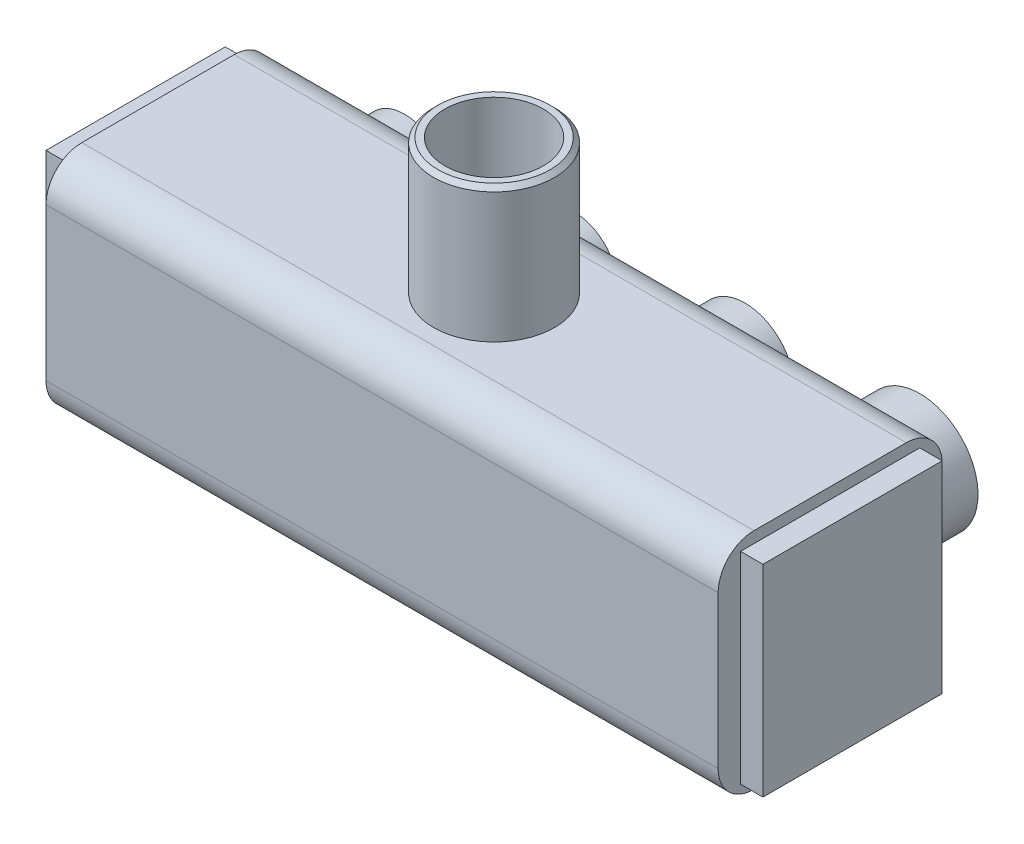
ISO-10303-21;
HEADER;
FILE_DESCRIPTION(('STEP AP214'),'2;1');
FILE_NAME('part.step','',(''),(''),'','','');
FILE_SCHEMA(('AUTOMOTIVE_DESIGN { 1 0 10303 214 1 1 1 1 }'));
ENDSEC;
DATA;
#1=APPLICATION_CONTEXT('core data for automotive mechanical design processes');
#2=APPLICATION_PROTOCOL_DEFINITION('international standard','automotive_design',2000,#1);
#3=PRODUCT_CONTEXT('',#1,'mechanical');
#4=PRODUCT('Part','Part','',(#3));
#5=PRODUCT_RELATED_PRODUCT_CATEGORY('part','',(#4));
#6=PRODUCT_DEFINITION_FORMATION('','',#4);
#7=PRODUCT_DEFINITION_CONTEXT('part definition',#1,'design');
#8=PRODUCT_DEFINITION('design','',#6,#7);
#9=PRODUCT_DEFINITION_SHAPE('','',#8);
#10=(LENGTH_UNIT() NAMED_UNIT(*) SI_UNIT(.MILLI.,.METRE.));
#11=(NAMED_UNIT(*) PLANE_ANGLE_UNIT() SI_UNIT($,.RADIAN.));
#12=(NAMED_UNIT(*) SI_UNIT($,.STERADIAN.) SOLID_ANGLE_UNIT());
#13=UNCERTAINTY_MEASURE_WITH_UNIT(LENGTH_MEASURE(1.E-05),#10,'distance_accuracy_value','');
#14=(GEOMETRIC_REPRESENTATION_CONTEXT(3) GLOBAL_UNCERTAINTY_ASSIGNED_CONTEXT((#13)) GLOBAL_UNIT_ASSIGNED_CONTEXT((#10,
#11,#12)) REPRESENTATION_CONTEXT('',''));
#15=CARTESIAN_POINT('',(0.,0.,0.));
#16=DIRECTION('',(0.,0.,1.));
#17=DIRECTION('',(1.,0.,0.));
#18=AXIS2_PLACEMENT_3D('',#15,#16,#17);
#19=CARTESIAN_POINT('',(-60.,0.,-40.));
#20=DIRECTION('',(0.,0.,-1.));
#21=DIRECTION('',(0.,1.,0.));
#22=AXIS2_PLACEMENT_3D('',#19,#20,#21);
#23=PLANE('',#22);
#24=CARTESIAN_POINT('',(-60.,0.,-40.));
#25=DIRECTION('',(0.,0.,-1.));
#26=DIRECTION('',(0.,1.,0.));
#27=AXIS2_PLACEMENT_3D('',#24,#25,#26);
#28=CIRCLE('',#27,9.5);
#29=CARTESIAN_POINT('',(-60.,9.5,-40.));
#30=VERTEX_POINT('',#29);
#31=EDGE_CURVE('E11',#30,#30,#28,.T.);
#32=ORIENTED_EDGE('',*,*,#31,.T.);
#33=EDGE_LOOP('',(#32));
#34=FACE_BOUND('',#33,.T.);
#35=CARTESIAN_POINT('',(-60.,0.,-40.));
#36=DIRECTION('',(0.,0.,-1.));
#37=DIRECTION('',(0.,1.,0.));
#38=AXIS2_PLACEMENT_3D('',#35,#36,#37);
#39=CIRCLE('',#38,6.);
#40=CARTESIAN_POINT('',(-60.,6.,-40.));
#41=VERTEX_POINT('',#40);
#42=EDGE_CURVE('E52',#41,#41,#39,.T.);
#43=ORIENTED_EDGE('',*,*,#42,.F.);
#44=EDGE_LOOP('',(#43));
#45=FACE_BOUND('',#44,.T.);
#46=ADVANCED_FACE('F41',(#34,#45),#23,.T.);
#47=CARTESIAN_POINT('',(-60.,0.,-10.));
#48=DIRECTION('',(0.,0.,-1.));
#49=DIRECTION('',(0.,1.,0.));
#50=AXIS2_PLACEMENT_3D('',#47,#48,#49);
#51=PLANE('',#50);
#52=CARTESIAN_POINT('',(-60.,0.,-10.));
#53=DIRECTION('',(0.,0.,-1.));
#54=DIRECTION('',(0.,1.,0.));
#55=AXIS2_PLACEMENT_3D('',#52,#53,#54);
#56=CIRCLE('',#55,9.5);
#57=CARTESIAN_POINT('',(-60.,9.5,-10.));
#58=VERTEX_POINT('',#57);
#59=EDGE_CURVE('E48',#58,#58,#56,.T.);
#60=ORIENTED_EDGE('',*,*,#59,.F.);
#61=EDGE_LOOP('',(#60));
#62=FACE_BOUND('',#61,.T.);
#63=CARTESIAN_POINT('',(-60.,0.,-10.));
#64=DIRECTION('',(0.,0.,-1.));
#65=DIRECTION('',(0.,1.,0.));
#66=AXIS2_PLACEMENT_3D('',#63,#64,#65);
#67=CIRCLE('',#66,6.);
#68=CARTESIAN_POINT('',(-60.,6.,-10.));
#69=VERTEX_POINT('',#68);
#70=EDGE_CURVE('E56',#69,#69,#67,.T.);
#71=ORIENTED_EDGE('',*,*,#70,.T.);
#72=EDGE_LOOP('',(#71));
#73=FACE_BOUND('',#72,.T.);
#74=ADVANCED_FACE('F62',(#62,#73),#51,.F.);
#75=CARTESIAN_POINT('',(-60.,0.,-40.));
#76=DIRECTION('',(0.,0.,1.));
#77=DIRECTION('',(0.,-1.,0.));
#78=AXIS2_PLACEMENT_3D('',#75,#76,#77);
#79=CYLINDRICAL_SURFACE('',#78,9.5);
#80=ORIENTED_EDGE('',*,*,#31,.F.);
#81=EDGE_LOOP('',(#80));
#82=FACE_BOUND('',#81,.T.);
#83=ORIENTED_EDGE('',*,*,#59,.T.);
#84=EDGE_LOOP('',(#83));
#85=FACE_BOUND('',#84,.T.);
#86=ADVANCED_FACE('F43',(#82,#85),#79,.T.);
#87=CARTESIAN_POINT('',(-60.,0.,-40.));
#88=DIRECTION('',(0.,0.,1.));
#89=DIRECTION('',(0.,-1.,0.));
#90=AXIS2_PLACEMENT_3D('',#87,#88,#89);
#91=CYLINDRICAL_SURFACE('',#90,6.);
#92=ORIENTED_EDGE('',*,*,#42,.T.);
#93=EDGE_LOOP('',(#92));
#94=FACE_BOUND('',#93,.T.);
#95=ORIENTED_EDGE('',*,*,#70,.F.);
#96=EDGE_LOOP('',(#95));
#97=FACE_BOUND('',#96,.T.);
#98=ADVANCED_FACE('F64',(#94,#97),#91,.F.);
#99=CLOSED_SHELL('',(#46,#74,#86,#98));
#100=MANIFOLD_SOLID_BREP('B2',#99);
#101=CARTESIAN_POINT('',(-22.,0.,-40.));
#102=DIRECTION('',(0.,0.,-1.));
#103=DIRECTION('',(0.,1.,0.));
#104=AXIS2_PLACEMENT_3D('',#101,#102,#103);
#105=PLANE('',#104);
#106=CARTESIAN_POINT('',(-22.,0.,-40.));
#107=DIRECTION('',(0.,0.,-1.));
#108=DIRECTION('',(0.,1.,0.));
#109=AXIS2_PLACEMENT_3D('',#106,#107,#108);
#110=CIRCLE('',#109,9.5);
#111=CARTESIAN_POINT('',(-22.,9.5,-40.));
#112=VERTEX_POINT('',#111);
#113=EDGE_CURVE('E40',#112,#112,#110,.T.);
#114=ORIENTED_EDGE('',*,*,#113,.T.);
#115=EDGE_LOOP('',(#114));
#116=FACE_BOUND('',#115,.T.);
#117=CARTESIAN_POINT('',(-22.,0.,-40.));
#118=DIRECTION('',(0.,0.,-1.));
#119=DIRECTION('',(0.,1.,0.));
#120=AXIS2_PLACEMENT_3D('',#117,#118,#119);
#121=CIRCLE('',#120,6.);
#122=CARTESIAN_POINT('',(-22.,6.,-40.));
#123=VERTEX_POINT('',#122);
#124=EDGE_CURVE('E113',#123,#123,#121,.T.);
#125=ORIENTED_EDGE('',*,*,#124,.F.);
#126=EDGE_LOOP('',(#125));
#127=FACE_BOUND('',#126,.T.);
#128=ADVANCED_FACE('F102',(#116,#127),#105,.T.);
#129=CARTESIAN_POINT('',(-22.,0.,-10.));
#130=DIRECTION('',(0.,0.,-1.));
#131=DIRECTION('',(0.,1.,0.));
#132=AXIS2_PLACEMENT_3D('',#129,#130,#131);
#133=PLANE('',#132);
#134=CARTESIAN_POINT('',(-22.,0.,-10.));
#135=DIRECTION('',(0.,0.,-1.));
#136=DIRECTION('',(0.,1.,0.));
#137=AXIS2_PLACEMENT_3D('',#134,#135,#136);
#138=CIRCLE('',#137,9.5);
#139=CARTESIAN_POINT('',(-22.,9.5,-10.));
#140=VERTEX_POINT('',#139);
#141=EDGE_CURVE('E109',#140,#140,#138,.T.);
#142=ORIENTED_EDGE('',*,*,#141,.F.);
#143=EDGE_LOOP('',(#142));
#144=FACE_BOUND('',#143,.T.);
#145=CARTESIAN_POINT('',(-22.,0.,-10.));
#146=DIRECTION('',(0.,0.,-1.));
#147=DIRECTION('',(0.,1.,0.));
#148=AXIS2_PLACEMENT_3D('',#145,#146,#147);
#149=CIRCLE('',#148,6.);
#150=CARTESIAN_POINT('',(-22.,6.,-10.));
#151=VERTEX_POINT('',#150);
#152=EDGE_CURVE('E117',#151,#151,#149,.T.);
#153=ORIENTED_EDGE('',*,*,#152,.T.);
#154=EDGE_LOOP('',(#153));
#155=FACE_BOUND('',#154,.T.);
#156=ADVANCED_FACE('F123',(#144,#155),#133,.F.);
#157=CARTESIAN_POINT('',(-22.,0.,-40.));
#158=DIRECTION('',(0.,0.,1.));
#159=DIRECTION('',(0.,-1.,0.));
#160=AXIS2_PLACEMENT_3D('',#157,#158,#159);
#161=CYLINDRICAL_SURFACE('',#160,9.5);
#162=ORIENTED_EDGE('',*,*,#113,.F.);
#163=EDGE_LOOP('',(#162));
#164=FACE_BOUND('',#163,.T.);
#165=ORIENTED_EDGE('',*,*,#141,.T.);
#166=EDGE_LOOP('',(#165));
#167=FACE_BOUND('',#166,.T.);
#168=ADVANCED_FACE('F104',(#164,#167),#161,.T.);
#169=CARTESIAN_POINT('',(-22.,0.,-40.));
#170=DIRECTION('',(0.,0.,1.));
#171=DIRECTION('',(0.,-1.,0.));
#172=AXIS2_PLACEMENT_3D('',#169,#170,#171);
#173=CYLINDRICAL_SURFACE('',#172,6.);
#174=ORIENTED_EDGE('',*,*,#124,.T.);
#175=EDGE_LOOP('',(#174));
#176=FACE_BOUND('',#175,.T.);
#177=ORIENTED_EDGE('',*,*,#152,.F.);
#178=EDGE_LOOP('',(#177));
#179=FACE_BOUND('',#178,.T.);
#180=ADVANCED_FACE('F125',(#176,#179),#173,.F.);
#181=CLOSED_SHELL('',(#128,#156,#168,#180));
#182=MANIFOLD_SOLID_BREP('B6',#181);
#183=CARTESIAN_POINT('',(16.,0.,-40.));
#184=DIRECTION('',(0.,0.,-1.));
#185=DIRECTION('',(0.,1.,0.));
#186=AXIS2_PLACEMENT_3D('',#183,#184,#185);
#187=PLANE('',#186);
#188=CARTESIAN_POINT('',(16.,0.,-40.));
#189=DIRECTION('',(0.,0.,-1.));
#190=DIRECTION('',(0.,1.,0.));
#191=AXIS2_PLACEMENT_3D('',#188,#189,#190);
#192=CIRCLE('',#191,11.);
#193=CARTESIAN_POINT('',(16.,11.,-40.));
#194=VERTEX_POINT('',#193);
#195=EDGE_CURVE('E101',#194,#194,#192,.T.);
#196=ORIENTED_EDGE('',*,*,#195,.T.);
#197=EDGE_LOOP('',(#196));
#198=FACE_BOUND('',#197,.T.);
#199=CARTESIAN_POINT('',(16.,0.,-40.));
#200=DIRECTION('',(0.,0.,-1.));
#201=DIRECTION('',(0.,1.,0.));
#202=AXIS2_PLACEMENT_3D('',#199,#200,#201);
#203=CIRCLE('',#202,7.75);
#204=CARTESIAN_POINT('',(16.,7.75,-40.));
#205=VERTEX_POINT('',#204);
#206=EDGE_CURVE('E174',#205,#205,#203,.T.);
#207=ORIENTED_EDGE('',*,*,#206,.F.);
#208=EDGE_LOOP('',(#207));
#209=FACE_BOUND('',#208,.T.);
#210=ADVANCED_FACE('F163',(#198,#209),#187,.T.);
#211=CARTESIAN_POINT('',(16.,0.,-10.));
#212=DIRECTION('',(0.,0.,-1.));
#213=DIRECTION('',(0.,1.,0.));
#214=AXIS2_PLACEMENT_3D('',#211,#212,#213);
#215=PLANE('',#214);
#216=CARTESIAN_POINT('',(16.,0.,-10.));
#217=DIRECTION('',(0.,0.,-1.));
#218=DIRECTION('',(0.,1.,0.));
#219=AXIS2_PLACEMENT_3D('',#216,#217,#218);
#220=CIRCLE('',#219,11.);
#221=CARTESIAN_POINT('',(16.,11.,-10.));
#222=VERTEX_POINT('',#221);
#223=EDGE_CURVE('E170',#222,#222,#220,.T.);
#224=ORIENTED_EDGE('',*,*,#223,.F.);
#225=EDGE_LOOP('',(#224));
#226=FACE_BOUND('',#225,.T.);
#227=CARTESIAN_POINT('',(16.,0.,-10.));
#228=DIRECTION('',(0.,0.,-1.));
#229=DIRECTION('',(0.,1.,0.));
#230=AXIS2_PLACEMENT_3D('',#227,#228,#229);
#231=CIRCLE('',#230,7.75);
#232=CARTESIAN_POINT('',(16.,7.75,-10.));
#233=VERTEX_POINT('',#232);
#234=EDGE_CURVE('E178',#233,#233,#231,.T.);
#235=ORIENTED_EDGE('',*,*,#234,.T.);
#236=EDGE_LOOP('',(#235));
#237=FACE_BOUND('',#236,.T.);
#238=ADVANCED_FACE('F184',(#226,#237),#215,.F.);
#239=CARTESIAN_POINT('',(16.,0.,-40.));
#240=DIRECTION('',(0.,0.,1.));
#241=DIRECTION('',(0.,-1.,0.));
#242=AXIS2_PLACEMENT_3D('',#239,#240,#241);
#243=CYLINDRICAL_SURFACE('',#242,11.);
#244=ORIENTED_EDGE('',*,*,#195,.F.);
#245=EDGE_LOOP('',(#244));
#246=FACE_BOUND('',#245,.T.);
#247=ORIENTED_EDGE('',*,*,#223,.T.);
#248=EDGE_LOOP('',(#247));
#249=FACE_BOUND('',#248,.T.);
#250=ADVANCED_FACE('F165',(#246,#249),#243,.T.);
#251=CARTESIAN_POINT('',(16.,0.,-40.));
#252=DIRECTION('',(0.,0.,1.));
#253=DIRECTION('',(0.,-1.,0.));
#254=AXIS2_PLACEMENT_3D('',#251,#252,#253);
#255=CYLINDRICAL_SURFACE('',#254,7.75);
#256=ORIENTED_EDGE('',*,*,#206,.T.);
#257=EDGE_LOOP('',(#256));
#258=FACE_BOUND('',#257,.T.);
#259=ORIENTED_EDGE('',*,*,#234,.F.);
#260=EDGE_LOOP('',(#259));
#261=FACE_BOUND('',#260,.T.);
#262=ADVANCED_FACE('F186',(#258,#261),#255,.F.);
#263=CLOSED_SHELL('',(#210,#238,#250,#262));
#264=MANIFOLD_SOLID_BREP('B35',#263);
#265=CARTESIAN_POINT('',(55.,0.,-10.));
#266=DIRECTION('',(0.,0.,1.));
#267=DIRECTION('',(0.,-1.,0.));
#268=AXIS2_PLACEMENT_3D('',#265,#266,#267);
#269=PLANE('',#268);
#270=CARTESIAN_POINT('',(55.,0.,-10.));
#271=DIRECTION('',(0.,0.,1.));
#272=DIRECTION('',(0.,-1.,0.));
#273=AXIS2_PLACEMENT_3D('',#270,#271,#272);
#274=CIRCLE('',#273,13.);
#275=CARTESIAN_POINT('',(55.,-13.,-10.));
#276=VERTEX_POINT('',#275);
#277=EDGE_CURVE('E162',#276,#276,#274,.T.);
#278=ORIENTED_EDGE('',*,*,#277,.T.);
#279=EDGE_LOOP('',(#278));
#280=FACE_BOUND('',#279,.T.);
#281=CARTESIAN_POINT('',(55.,0.,-10.));
#282=DIRECTION('',(0.,0.,1.));
#283=DIRECTION('',(0.,-1.,0.));
#284=AXIS2_PLACEMENT_3D('',#281,#282,#283);
#285=CIRCLE('',#284,9.5);
#286=CARTESIAN_POINT('',(55.,-9.50000000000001,-10.));
#287=VERTEX_POINT('',#286);
#288=EDGE_CURVE('E235',#287,#287,#285,.T.);
#289=ORIENTED_EDGE('',*,*,#288,.F.);
#290=EDGE_LOOP('',(#289));
#291=FACE_BOUND('',#290,.T.);
#292=ADVANCED_FACE('F224',(#280,#291),#269,.T.);
#293=CARTESIAN_POINT('',(55.,0.,-40.));
#294=DIRECTION('',(0.,0.,1.));
#295=DIRECTION('',(0.,-1.,0.));
#296=AXIS2_PLACEMENT_3D('',#293,#294,#295);
#297=PLANE('',#296);
#298=CARTESIAN_POINT('',(55.,0.,-40.));
#299=DIRECTION('',(0.,0.,1.));
#300=DIRECTION('',(0.,-1.,0.));
#301=AXIS2_PLACEMENT_3D('',#298,#299,#300);
#302=CIRCLE('',#301,13.);
#303=CARTESIAN_POINT('',(55.,-13.,-40.));
#304=VERTEX_POINT('',#303);
#305=EDGE_CURVE('E231',#304,#304,#302,.T.);
#306=ORIENTED_EDGE('',*,*,#305,.F.);
#307=EDGE_LOOP('',(#306));
#308=FACE_BOUND('',#307,.T.);
#309=CARTESIAN_POINT('',(55.,0.,-40.));
#310=DIRECTION('',(0.,0.,1.));
#311=DIRECTION('',(0.,-1.,0.));
#312=AXIS2_PLACEMENT_3D('',#309,#310,#311);
#313=CIRCLE('',#312,9.5);
#314=CARTESIAN_POINT('',(55.,-9.50000000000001,-40.));
#315=VERTEX_POINT('',#314);
#316=EDGE_CURVE('E239',#315,#315,#313,.T.);
#317=ORIENTED_EDGE('',*,*,#316,.T.);
#318=EDGE_LOOP('',(#317));
#319=FACE_BOUND('',#318,.T.);
#320=ADVANCED_FACE('F245',(#308,#319),#297,.F.);
#321=CARTESIAN_POINT('',(55.,0.,-10.));
#322=DIRECTION('',(0.,0.,-1.));
#323=DIRECTION('',(0.,1.,0.));
#324=AXIS2_PLACEMENT_3D('',#321,#322,#323);
#325=CYLINDRICAL_SURFACE('',#324,13.);
#326=ORIENTED_EDGE('',*,*,#277,.F.);
#327=EDGE_LOOP('',(#326));
#328=FACE_BOUND('',#327,.T.);
#329=ORIENTED_EDGE('',*,*,#305,.T.);
#330=EDGE_LOOP('',(#329));
#331=FACE_BOUND('',#330,.T.);
#332=ADVANCED_FACE('F226',(#328,#331),#325,.T.);
#333=CARTESIAN_POINT('',(55.,0.,-10.));
#334=DIRECTION('',(0.,0.,-1.));
#335=DIRECTION('',(0.,1.,0.));
#336=AXIS2_PLACEMENT_3D('',#333,#334,#335);
#337=CYLINDRICAL_SURFACE('',#336,9.5);
#338=ORIENTED_EDGE('',*,*,#288,.T.);
#339=EDGE_LOOP('',(#338));
#340=FACE_BOUND('',#339,.T.);
#341=ORIENTED_EDGE('',*,*,#316,.F.);
#342=EDGE_LOOP('',(#341));
#343=FACE_BOUND('',#342,.T.);
#344=ADVANCED_FACE('F247',(#340,#343),#337,.F.);
#345=CLOSED_SHELL('',(#292,#320,#332,#344));
#346=MANIFOLD_SOLID_BREP('B96',#345);
#347=CARTESIAN_POINT('',(0.,55.,0.));
#348=DIRECTION('',(0.,1.,0.));
#349=DIRECTION('',(0.,0.,1.));
#350=AXIS2_PLACEMENT_3D('',#347,#348,#349);
#351=PLANE('',#350);
#352=CARTESIAN_POINT('',(0.,55.,0.));
#353=DIRECTION('',(0.,1.,0.));
#354=DIRECTION('',(0.,0.,1.));
#355=AXIS2_PLACEMENT_3D('',#352,#353,#354);
#356=CIRCLE('',#355,12.5);
#357=CARTESIAN_POINT('',(0.,55.,12.5));
#358=VERTEX_POINT('',#357);
#359=EDGE_CURVE('E294',#358,#358,#356,.T.);
#360=ORIENTED_EDGE('',*,*,#359,.T.);
#361=EDGE_LOOP('',(#360));
#362=FACE_BOUND('',#361,.T.);
#363=CARTESIAN_POINT('',(0.,55.,0.));
#364=DIRECTION('',(0.,1.,0.));
#365=DIRECTION('',(0.,0.,1.));
#366=AXIS2_PLACEMENT_3D('',#363,#364,#365);
#367=CIRCLE('',#366,11.);
#368=CARTESIAN_POINT('',(0.,55.,11.));
#369=VERTEX_POINT('',#368);
#370=EDGE_CURVE('E302',#369,#369,#367,.T.);
#371=ORIENTED_EDGE('',*,*,#370,.F.);
#372=EDGE_LOOP('',(#371));
#373=FACE_BOUND('',#372,.T.);
#374=ADVANCED_FACE('F287',(#362,#373),#351,.T.);
#375=CARTESIAN_POINT('',(0.,25.,0.));
#376=DIRECTION('',(0.,1.,0.));
#377=DIRECTION('',(0.,0.,1.));
#378=AXIS2_PLACEMENT_3D('',#375,#376,#377);
#379=PLANE('',#378);
#380=CARTESIAN_POINT('',(0.,25.,0.));
#381=DIRECTION('',(0.,1.,0.));
#382=DIRECTION('',(0.,0.,1.));
#383=AXIS2_PLACEMENT_3D('',#380,#381,#382);
#384=CIRCLE('',#383,13.5);
#385=CARTESIAN_POINT('',(0.,25.,13.5));
#386=VERTEX_POINT('',#385);
#387=EDGE_CURVE('E298',#386,#386,#384,.T.);
#388=ORIENTED_EDGE('',*,*,#387,.F.);
#389=EDGE_LOOP('',(#388));
#390=FACE_BOUND('',#389,.T.);
#391=CARTESIAN_POINT('',(0.,25.,0.));
#392=DIRECTION('',(0.,1.,0.));
#393=DIRECTION('',(0.,0.,1.));
#394=AXIS2_PLACEMENT_3D('',#391,#392,#393);
#395=CIRCLE('',#394,11.);
#396=CARTESIAN_POINT('',(0.,25.,11.));
#397=VERTEX_POINT('',#396);
#398=EDGE_CURVE('E307',#397,#397,#395,.T.);
#399=ORIENTED_EDGE('',*,*,#398,.T.);
#400=EDGE_LOOP('',(#399));
#401=FACE_BOUND('',#400,.T.);
#402=ADVANCED_FACE('F311',(#390,#401),#379,.F.);
#403=CARTESIAN_POINT('',(0.,55.,0.));
#404=DIRECTION('',(0.,-1.,0.));
#405=DIRECTION('',(0.,0.,-1.));
#406=AXIS2_PLACEMENT_3D('',#403,#404,#405);
#407=CYLINDRICAL_SURFACE('',#406,13.5);
#408=CARTESIAN_POINT('',(0.,54.,0.));
#409=DIRECTION('',(0.,1.,0.));
#410=DIRECTION('',(0.,0.,1.));
#411=AXIS2_PLACEMENT_3D('',#408,#409,#410);
#412=CIRCLE('',#411,13.5);
#413=CARTESIAN_POINT('',(0.,54.,13.5));
#414=VERTEX_POINT('',#413);
#415=EDGE_CURVE('E223',#414,#414,#412,.F.);
#416=ORIENTED_EDGE('',*,*,#415,.T.);
#417=EDGE_LOOP('',(#416));
#418=FACE_BOUND('',#417,.T.);
#419=ORIENTED_EDGE('',*,*,#387,.T.);
#420=EDGE_LOOP('',(#419));
#421=FACE_BOUND('',#420,.T.);
#422=ADVANCED_FACE('F289',(#418,#421),#407,.T.);
#423=CARTESIAN_POINT('',(0.,55.,0.));
#424=DIRECTION('',(0.,-1.,0.));
#425=DIRECTION('',(0.,0.,-1.));
#426=AXIS2_PLACEMENT_3D('',#423,#424,#425);
#427=CYLINDRICAL_SURFACE('',#426,11.);
#428=ORIENTED_EDGE('',*,*,#370,.T.);
#429=EDGE_LOOP('',(#428));
#430=FACE_BOUND('',#429,.T.);
#431=ORIENTED_EDGE('',*,*,#398,.F.);
#432=EDGE_LOOP('',(#431));
#433=FACE_BOUND('',#432,.T.);
#434=ADVANCED_FACE('F313',(#430,#433),#427,.F.);
#435=CARTESIAN_POINT('',(0.,55.,0.));
#436=DIRECTION('',(0.,-1.,0.));
#437=DIRECTION('',(0.,0.,-1.));
#438=AXIS2_PLACEMENT_3D('',#435,#436,#437);
#439=CONICAL_SURFACE('',#438,12.5,0.785398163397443);
#440=ORIENTED_EDGE('',*,*,#415,.F.);
#441=EDGE_LOOP('',(#440));
#442=FACE_BOUND('',#441,.T.);
#443=ORIENTED_EDGE('',*,*,#359,.F.);
#444=EDGE_LOOP('',(#443));
#445=FACE_BOUND('',#444,.T.);
#446=ADVANCED_FACE('F315',(#442,#445),#439,.T.);
#447=CLOSED_SHELL('',(#374,#402,#422,#434,#446));
#448=MANIFOLD_SOLID_BREP('B157',#447);
#449=CARTESIAN_POINT('',(-80.,-22.5,-20.));
#450=DIRECTION('',(0.,0.,1.));
#451=DIRECTION('',(0.,-1.,0.));
#452=AXIS2_PLACEMENT_3D('',#449,#450,#451);
#453=PLANE('',#452);
#454=DIRECTION('',(-1.,0.,0.));
#455=VECTOR('',#454,1.);
#456=CARTESIAN_POINT('',(-80.,22.5,-20.));
#457=LINE('',#456,#455);
#458=CARTESIAN_POINT('',(-75.,22.5,-20.));
#459=VERTEX_POINT('',#458);
#460=CARTESIAN_POINT('',(-80.,22.5,-20.));
#461=VERTEX_POINT('',#460);
#462=EDGE_CURVE('E412',#459,#461,#457,.T.);
#463=ORIENTED_EDGE('',*,*,#462,.F.);
#464=DIRECTION('',(0.,1.,0.));
#465=VECTOR('',#464,1.);
#466=CARTESIAN_POINT('',(-75.,-22.5,-20.));
#467=LINE('',#466,#465);
#468=CARTESIAN_POINT('',(-75.,-22.5,-20.));
#469=VERTEX_POINT('',#468);
#470=EDGE_CURVE('E431',#469,#459,#467,.T.);
#471=ORIENTED_EDGE('',*,*,#470,.F.);
#472=DIRECTION('',(-1.,0.,0.));
#473=VECTOR('',#472,1.);
#474=CARTESIAN_POINT('',(-80.,-22.5,-20.));
#475=LINE('',#474,#473);
#476=CARTESIAN_POINT('',(-80.,-22.5,-20.));
#477=VERTEX_POINT('',#476);
#478=EDGE_CURVE('E417',#469,#477,#475,.T.);
#479=ORIENTED_EDGE('',*,*,#478,.T.);
#480=DIRECTION('',(0.,1.,0.));
#481=VECTOR('',#480,1.);
#482=CARTESIAN_POINT('',(-80.,-22.5,-20.));
#483=LINE('',#482,#481);
#484=EDGE_CURVE('E285',#477,#461,#483,.T.);
#485=ORIENTED_EDGE('',*,*,#484,.T.);
#486=EDGE_LOOP('',(#463,#471,#479,#485));
#487=FACE_BOUND('',#486,.T.);
#488=ADVANCED_FACE('F364',(#487),#453,.F.);
#489=CARTESIAN_POINT('',(-80.,-22.5,-20.));
#490=DIRECTION('',(1.,0.,0.));
#491=DIRECTION('',(0.,0.,1.));
#492=AXIS2_PLACEMENT_3D('',#489,#490,#491);
#493=PLANE('',#492);
#494=DIRECTION('',(0.,0.,1.));
#495=VECTOR('',#494,1.);
#496=CARTESIAN_POINT('',(-80.,22.5,-20.));
#497=LINE('',#496,#495);
#498=CARTESIAN_POINT('',(-80.,22.5,20.));
#499=VERTEX_POINT('',#498);
#500=EDGE_CURVE('E403',#461,#499,#497,.T.);
#501=ORIENTED_EDGE('',*,*,#500,.F.);
#502=ORIENTED_EDGE('',*,*,#484,.F.);
#503=DIRECTION('',(0.,0.,1.));
#504=VECTOR('',#503,1.);
#505=CARTESIAN_POINT('',(-80.,-22.5,-20.));
#506=LINE('',#505,#504);
#507=CARTESIAN_POINT('',(-80.,-22.5,20.));
#508=VERTEX_POINT('',#507);
#509=EDGE_CURVE('E425',#477,#508,#506,.T.);
#510=ORIENTED_EDGE('',*,*,#509,.T.);
#511=DIRECTION('',(0.,1.,0.));
#512=VECTOR('',#511,1.);
#513=CARTESIAN_POINT('',(-80.,-22.5,20.));
#514=LINE('',#513,#512);
#515=EDGE_CURVE('E371',#508,#499,#514,.T.);
#516=ORIENTED_EDGE('',*,*,#515,.T.);
#517=EDGE_LOOP('',(#501,#502,#510,#516));
#518=FACE_BOUND('',#517,.T.);
#519=ADVANCED_FACE('F404',(#518),#493,.F.);
#520=CARTESIAN_POINT('',(-80.,-22.5,20.));
#521=DIRECTION('',(0.,0.,-1.));
#522=DIRECTION('',(0.,1.,0.));
#523=AXIS2_PLACEMENT_3D('',#520,#521,#522);
#524=PLANE('',#523);
#525=DIRECTION('',(1.,0.,0.));
#526=VECTOR('',#525,1.);
#527=CARTESIAN_POINT('',(-80.,22.5,20.));
#528=LINE('',#527,#526);
#529=CARTESIAN_POINT('',(-75.,22.5,20.));
#530=VERTEX_POINT('',#529);
#531=EDGE_CURVE('E411',#499,#530,#528,.T.);
#532=ORIENTED_EDGE('',*,*,#531,.F.);
#533=ORIENTED_EDGE('',*,*,#515,.F.);
#534=DIRECTION('',(1.,0.,0.));
#535=VECTOR('',#534,1.);
#536=CARTESIAN_POINT('',(-80.,-22.5,20.));
#537=LINE('',#536,#535);
#538=CARTESIAN_POINT('',(-75.,-22.5,20.));
#539=VERTEX_POINT('',#538);
#540=EDGE_CURVE('E427',#508,#539,#537,.T.);
#541=ORIENTED_EDGE('',*,*,#540,.T.);
#542=DIRECTION('',(0.,1.,0.));
#543=VECTOR('',#542,1.);
#544=CARTESIAN_POINT('',(-75.,-22.5,20.));
#545=LINE('',#544,#543);
#546=EDGE_CURVE('E433',#539,#530,#545,.T.);
#547=ORIENTED_EDGE('',*,*,#546,.T.);
#548=EDGE_LOOP('',(#532,#533,#541,#547));
#549=FACE_BOUND('',#548,.T.);
#550=ADVANCED_FACE('F436',(#549),#524,.F.);
#551=CARTESIAN_POINT('',(-75.,-22.5,-20.));
#552=DIRECTION('',(-1.,0.,0.));
#553=DIRECTION('',(0.,0.,-1.));
#554=AXIS2_PLACEMENT_3D('',#551,#552,#553);
#555=PLANE('',#554);
#556=DIRECTION('',(0.,0.,-1.));
#557=VECTOR('',#556,1.);
#558=CARTESIAN_POINT('',(-75.,22.5,-20.));
#559=LINE('',#558,#557);
#560=EDGE_CURVE('E419',#530,#459,#559,.T.);
#561=ORIENTED_EDGE('',*,*,#560,.F.);
#562=ORIENTED_EDGE('',*,*,#546,.F.);
#563=DIRECTION('',(0.,0.,-1.));
#564=VECTOR('',#563,1.);
#565=CARTESIAN_POINT('',(-75.,-22.5,-20.));
#566=LINE('',#565,#564);
#567=EDGE_CURVE('E378',#539,#469,#566,.T.);
#568=ORIENTED_EDGE('',*,*,#567,.T.);
#569=ORIENTED_EDGE('',*,*,#470,.T.);
#570=EDGE_LOOP('',(#561,#562,#568,#569));
#571=FACE_BOUND('',#570,.T.);
#572=ADVANCED_FACE('F437',(#571),#555,.F.);
#573=CARTESIAN_POINT('',(-75.,-22.5,-20.));
#574=DIRECTION('',(0.,1.,0.));
#575=DIRECTION('',(0.,0.,1.));
#576=AXIS2_PLACEMENT_3D('',#573,#574,#575);
#577=PLANE('',#576);
#578=ORIENTED_EDGE('',*,*,#478,.F.);
#579=ORIENTED_EDGE('',*,*,#567,.F.);
#580=ORIENTED_EDGE('',*,*,#540,.F.);
#581=ORIENTED_EDGE('',*,*,#509,.F.);
#582=EDGE_LOOP('',(#578,#579,#580,#581));
#583=FACE_BOUND('',#582,.T.);
#584=ADVANCED_FACE('F439',(#583),#577,.F.);
#585=CARTESIAN_POINT('',(-75.,22.5,-20.));
#586=DIRECTION('',(0.,1.,0.));
#587=DIRECTION('',(0.,0.,1.));
#588=AXIS2_PLACEMENT_3D('',#585,#586,#587);
#589=PLANE('',#588);
#590=ORIENTED_EDGE('',*,*,#462,.T.);
#591=ORIENTED_EDGE('',*,*,#500,.T.);
#592=ORIENTED_EDGE('',*,*,#531,.T.);
#593=ORIENTED_EDGE('',*,*,#560,.T.);
#594=EDGE_LOOP('',(#590,#591,#592,#593));
#595=FACE_BOUND('',#594,.T.);
#596=ADVANCED_FACE('F418',(#595),#589,.T.);
#597=CLOSED_SHELL('',(#488,#519,#550,#572,#584,#596));
#598=MANIFOLD_SOLID_BREP('B218',#597);
#599=CARTESIAN_POINT('',(80.,-22.5,-20.));
#600=DIRECTION('',(0.,0.,1.));
#601=DIRECTION('',(0.,-1.,0.));
#602=AXIS2_PLACEMENT_3D('',#599,#600,#601);
#603=PLANE('',#602);
#604=DIRECTION('',(1.,0.,0.));
#605=VECTOR('',#604,1.);
#606=CARTESIAN_POINT('',(80.,22.5,-20.));
#607=LINE('',#606,#605);
#608=CARTESIAN_POINT('',(75.,22.5,-20.));
#609=VERTEX_POINT('',#608);
#610=CARTESIAN_POINT('',(80.,22.5,-20.));
#611=VERTEX_POINT('',#610);
#612=EDGE_CURVE('E553',#609,#611,#607,.T.);
#613=ORIENTED_EDGE('',*,*,#612,.T.);
#614=DIRECTION('',(0.,1.,0.));
#615=VECTOR('',#614,1.);
#616=CARTESIAN_POINT('',(80.,-22.5,-20.));
#617=LINE('',#616,#615);
#618=CARTESIAN_POINT('',(80.,-22.5,-20.));
#619=VERTEX_POINT('',#618);
#620=EDGE_CURVE('E362',#619,#611,#617,.T.);
#621=ORIENTED_EDGE('',*,*,#620,.F.);
#622=DIRECTION('',(1.,0.,0.));
#623=VECTOR('',#622,1.);
#624=CARTESIAN_POINT('',(80.,-22.5,-20.));
#625=LINE('',#624,#623);
#626=CARTESIAN_POINT('',(75.,-22.5,-20.));
#627=VERTEX_POINT('',#626);
#628=EDGE_CURVE('E571',#627,#619,#625,.T.);
#629=ORIENTED_EDGE('',*,*,#628,.F.);
#630=DIRECTION('',(0.,1.,0.));
#631=VECTOR('',#630,1.);
#632=CARTESIAN_POINT('',(75.,-22.5,-20.));
#633=LINE('',#632,#631);
#634=EDGE_CURVE('E565',#627,#609,#633,.T.);
#635=ORIENTED_EDGE('',*,*,#634,.T.);
#636=EDGE_LOOP('',(#613,#621,#629,#635));
#637=FACE_BOUND('',#636,.T.);
#638=ADVANCED_FACE('F509',(#637),#603,.F.);
#639=CARTESIAN_POINT('',(80.,-22.5,-20.));
#640=DIRECTION('',(-1.,0.,0.));
#641=DIRECTION('',(0.,0.,1.));
#642=AXIS2_PLACEMENT_3D('',#639,#640,#641);
#643=PLANE('',#642);
#644=DIRECTION('',(0.,0.,1.));
#645=VECTOR('',#644,1.);
#646=CARTESIAN_POINT('',(80.,22.5,-20.));
#647=LINE('',#646,#645);
#648=CARTESIAN_POINT('',(80.,22.5,20.));
#649=VERTEX_POINT('',#648);
#650=EDGE_CURVE('E549',#611,#649,#647,.T.);
#651=ORIENTED_EDGE('',*,*,#650,.T.);
#652=DIRECTION('',(0.,1.,0.));
#653=VECTOR('',#652,1.);
#654=CARTESIAN_POINT('',(80.,-22.5,20.));
#655=LINE('',#654,#653);
#656=CARTESIAN_POINT('',(80.,-22.5,20.));
#657=VERTEX_POINT('',#656);
#658=EDGE_CURVE('E516',#657,#649,#655,.T.);
#659=ORIENTED_EDGE('',*,*,#658,.F.);
#660=DIRECTION('',(0.,0.,1.));
#661=VECTOR('',#660,1.);
#662=CARTESIAN_POINT('',(80.,-22.5,-20.));
#663=LINE('',#662,#661);
#664=EDGE_CURVE('E561',#619,#657,#663,.T.);
#665=ORIENTED_EDGE('',*,*,#664,.F.);
#666=ORIENTED_EDGE('',*,*,#620,.T.);
#667=EDGE_LOOP('',(#651,#659,#665,#666));
#668=FACE_BOUND('',#667,.T.);
#669=ADVANCED_FACE('F560',(#668),#643,.F.);
#670=CARTESIAN_POINT('',(80.,-22.5,20.));
#671=DIRECTION('',(0.,0.,-1.));
#672=DIRECTION('',(0.,1.,0.));
#673=AXIS2_PLACEMENT_3D('',#670,#671,#672);
#674=PLANE('',#673);
#675=DIRECTION('',(-1.,0.,0.));
#676=VECTOR('',#675,1.);
#677=CARTESIAN_POINT('',(80.,22.5,20.));
#678=LINE('',#677,#676);
#679=CARTESIAN_POINT('',(75.,22.5,20.));
#680=VERTEX_POINT('',#679);
#681=EDGE_CURVE('E554',#649,#680,#678,.T.);
#682=ORIENTED_EDGE('',*,*,#681,.T.);
#683=DIRECTION('',(0.,1.,0.));
#684=VECTOR('',#683,1.);
#685=CARTESIAN_POINT('',(75.,-22.5,20.));
#686=LINE('',#685,#684);
#687=CARTESIAN_POINT('',(75.,-22.5,20.));
#688=VERTEX_POINT('',#687);
#689=EDGE_CURVE('E577',#688,#680,#686,.T.);
#690=ORIENTED_EDGE('',*,*,#689,.F.);
#691=DIRECTION('',(-1.,0.,0.));
#692=VECTOR('',#691,1.);
#693=CARTESIAN_POINT('',(80.,-22.5,20.));
#694=LINE('',#693,#692);
#695=EDGE_CURVE('E528',#657,#688,#694,.T.);
#696=ORIENTED_EDGE('',*,*,#695,.F.);
#697=ORIENTED_EDGE('',*,*,#658,.T.);
#698=EDGE_LOOP('',(#682,#690,#696,#697));
#699=FACE_BOUND('',#698,.T.);
#700=ADVANCED_FACE('F580',(#699),#674,.F.);
#701=CARTESIAN_POINT('',(75.,-22.5,-20.));
#702=DIRECTION('',(1.,0.,0.));
#703=DIRECTION('',(0.,0.,-1.));
#704=AXIS2_PLACEMENT_3D('',#701,#702,#703);
#705=PLANE('',#704);
#706=DIRECTION('',(0.,0.,-1.));
#707=VECTOR('',#706,1.);
#708=CARTESIAN_POINT('',(75.,22.5,-20.));
#709=LINE('',#708,#707);
#710=EDGE_CURVE('E569',#680,#609,#709,.T.);
#711=ORIENTED_EDGE('',*,*,#710,.T.);
#712=ORIENTED_EDGE('',*,*,#634,.F.);
#713=DIRECTION('',(0.,0.,-1.));
#714=VECTOR('',#713,1.);
#715=CARTESIAN_POINT('',(75.,-22.5,-20.));
#716=LINE('',#715,#714);
#717=EDGE_CURVE('E523',#688,#627,#716,.T.);
#718=ORIENTED_EDGE('',*,*,#717,.F.);
#719=ORIENTED_EDGE('',*,*,#689,.T.);
#720=EDGE_LOOP('',(#711,#712,#718,#719));
#721=FACE_BOUND('',#720,.T.);
#722=ADVANCED_FACE('F582',(#721),#705,.F.);
#723=CARTESIAN_POINT('',(75.,-22.5,-20.));
#724=DIRECTION('',(0.,1.,0.));
#725=DIRECTION('',(0.,0.,1.));
#726=AXIS2_PLACEMENT_3D('',#723,#724,#725);
#727=PLANE('',#726);
#728=ORIENTED_EDGE('',*,*,#628,.T.);
#729=ORIENTED_EDGE('',*,*,#664,.T.);
#730=ORIENTED_EDGE('',*,*,#695,.T.);
#731=ORIENTED_EDGE('',*,*,#717,.T.);
#732=EDGE_LOOP('',(#728,#729,#730,#731));
#733=FACE_BOUND('',#732,.T.);
#734=ADVANCED_FACE('F583',(#733),#727,.F.);
#735=CARTESIAN_POINT('',(75.,22.5,-20.));
#736=DIRECTION('',(0.,1.,0.));
#737=DIRECTION('',(0.,0.,1.));
#738=AXIS2_PLACEMENT_3D('',#735,#736,#737);
#739=PLANE('',#738);
#740=ORIENTED_EDGE('',*,*,#612,.F.);
#741=ORIENTED_EDGE('',*,*,#710,.F.);
#742=ORIENTED_EDGE('',*,*,#681,.F.);
#743=ORIENTED_EDGE('',*,*,#650,.F.);
#744=EDGE_LOOP('',(#740,#741,#742,#743));
#745=FACE_BOUND('',#744,.T.);
#746=ADVANCED_FACE('F550',(#745),#739,.T.);
#747=CLOSED_SHELL('',(#638,#669,#700,#722,#734,#746));
#748=MANIFOLD_SOLID_BREP('B279',#747);
#749=CARTESIAN_POINT('',(75.,17.,-25.));
#750=DIRECTION('',(0.,0.,1.));
#751=DIRECTION('',(1.,0.,0.));
#752=AXIS2_PLACEMENT_3D('',#749,#750,#751);
#753=PLANE('',#752);
#754=CARTESIAN_POINT('',(-22.,0.,-25.));
#755=DIRECTION('',(0.,0.,-1.));
#756=DIRECTION('',(-1.,0.,0.));
#757=AXIS2_PLACEMENT_3D('',#754,#755,#756);
#758=CIRCLE('',#757,9.74999999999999);
#759=CARTESIAN_POINT('',(-31.75,0.,-25.));
#760=VERTEX_POINT('',#759);
#761=EDGE_CURVE('E1176',#760,#760,#758,.T.);
#762=ORIENTED_EDGE('',*,*,#761,.F.);
#763=EDGE_LOOP('',(#762));
#764=FACE_BOUND('',#763,.T.);
#765=DIRECTION('',(0.,1.,0.));
#766=VECTOR('',#765,1.);
#767=CARTESIAN_POINT('',(-75.,17.,-25.));
#768=LINE('',#767,#766);
#769=CARTESIAN_POINT('',(-75.,-17.,-25.));
#770=VERTEX_POINT('',#769);
#771=CARTESIAN_POINT('',(-75.,17.,-25.));
#772=VERTEX_POINT('',#771);
#773=EDGE_CURVE('E817',#770,#772,#768,.T.);
#774=ORIENTED_EDGE('',*,*,#773,.T.);
#775=DIRECTION('',(-1.,0.,0.));
#776=VECTOR('',#775,1.);
#777=CARTESIAN_POINT('',(75.,17.,-25.));
#778=LINE('',#777,#776);
#779=CARTESIAN_POINT('',(75.,17.,-25.));
#780=VERTEX_POINT('',#779);
#781=EDGE_CURVE('E770',#780,#772,#778,.T.);
#782=ORIENTED_EDGE('',*,*,#781,.F.);
#783=DIRECTION('',(0.,1.,0.));
#784=VECTOR('',#783,1.);
#785=CARTESIAN_POINT('',(75.,17.,-25.));
#786=LINE('',#785,#784);
#787=CARTESIAN_POINT('',(75.,-17.,-25.));
#788=VERTEX_POINT('',#787);
#789=EDGE_CURVE('E662',#788,#780,#786,.T.);
#790=ORIENTED_EDGE('',*,*,#789,.F.);
#791=DIRECTION('',(-1.,0.,0.));
#792=VECTOR('',#791,1.);
#793=CARTESIAN_POINT('',(75.,-17.,-25.));
#794=LINE('',#793,#792);
#795=EDGE_CURVE('E856',#788,#770,#794,.T.);
#796=ORIENTED_EDGE('',*,*,#795,.T.);
#797=EDGE_LOOP('',(#774,#782,#790,#796));
#798=FACE_BOUND('',#797,.T.);
#799=CARTESIAN_POINT('',(55.,0.,-25.));
#800=DIRECTION('',(0.,0.,-1.));
#801=DIRECTION('',(-1.,0.,0.));
#802=AXIS2_PLACEMENT_3D('',#799,#800,#801);
#803=CIRCLE('',#802,13.25);
#804=CARTESIAN_POINT('',(41.75,0.,-25.));
#805=VERTEX_POINT('',#804);
#806=EDGE_CURVE('E1158',#805,#805,#803,.T.);
#807=ORIENTED_EDGE('',*,*,#806,.F.);
#808=EDGE_LOOP('',(#807));
#809=FACE_BOUND('',#808,.T.);
#810=CARTESIAN_POINT('',(16.,0.,-25.));
#811=DIRECTION('',(0.,0.,-1.));
#812=DIRECTION('',(-1.,0.,0.));
#813=AXIS2_PLACEMENT_3D('',#810,#811,#812);
#814=CIRCLE('',#813,11.25);
#815=CARTESIAN_POINT('',(4.75000000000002,0.,-25.));
#816=VERTEX_POINT('',#815);
#817=EDGE_CURVE('E1170',#816,#816,#814,.T.);
#818=ORIENTED_EDGE('',*,*,#817,.F.);
#819=EDGE_LOOP('',(#818));
#820=FACE_BOUND('',#819,.T.);
#821=CARTESIAN_POINT('',(-60.,0.,-25.));
#822=DIRECTION('',(0.,0.,-1.));
#823=DIRECTION('',(-1.,0.,0.));
#824=AXIS2_PLACEMENT_3D('',#821,#822,#823);
#825=CIRCLE('',#824,9.74999999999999);
#826=CARTESIAN_POINT('',(-69.75,0.,-25.));
#827=VERTEX_POINT('',#826);
#828=EDGE_CURVE('E1182',#827,#827,#825,.T.);
#829=ORIENTED_EDGE('',*,*,#828,.F.);
#830=EDGE_LOOP('',(#829));
#831=FACE_BOUND('',#830,.T.);
#832=ADVANCED_FACE('F645',(#764,#798,#809,#820,#831),#753,.F.);
#833=CARTESIAN_POINT('',(75.,17.,-17.));
#834=DIRECTION('',(-1.,0.,0.));
#835=DIRECTION('',(0.,0.,1.));
#836=AXIS2_PLACEMENT_3D('',#833,#834,#835);
#837=CYLINDRICAL_SURFACE('',#836,8.00000000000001);
#838=CARTESIAN_POINT('',(-75.,17.,-17.));
#839=DIRECTION('',(1.,0.,0.));
#840=DIRECTION('',(0.,0.,-1.));
#841=AXIS2_PLACEMENT_3D('',#838,#839,#840);
#842=CIRCLE('',#841,8.00000000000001);
#843=CARTESIAN_POINT('',(-75.,25.,-17.));
#844=VERTEX_POINT('',#843);
#845=EDGE_CURVE('E802',#772,#844,#842,.T.);
#846=ORIENTED_EDGE('',*,*,#845,.T.);
#847=DIRECTION('',(-1.,0.,0.));
#848=VECTOR('',#847,1.);
#849=CARTESIAN_POINT('',(75.,25.,-17.));
#850=LINE('',#849,#848);
#851=CARTESIAN_POINT('',(75.,25.,-17.));
#852=VERTEX_POINT('',#851);
#853=EDGE_CURVE('E507',#852,#844,#850,.T.);
#854=ORIENTED_EDGE('',*,*,#853,.F.);
#855=CARTESIAN_POINT('',(75.,17.,-17.));
#856=DIRECTION('',(1.,0.,0.));
#857=DIRECTION('',(0.,0.,-1.));
#858=AXIS2_PLACEMENT_3D('',#855,#856,#857);
#859=CIRCLE('',#858,8.00000000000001);
#860=EDGE_CURVE('E840',#780,#852,#859,.T.);
#861=ORIENTED_EDGE('',*,*,#860,.F.);
#862=ORIENTED_EDGE('',*,*,#781,.T.);
#863=EDGE_LOOP('',(#846,#854,#861,#862));
#864=FACE_BOUND('',#863,.T.);
#865=ADVANCED_FACE('F919',(#864),#837,.T.);
#866=CARTESIAN_POINT('',(75.,25.,-17.));
#867=DIRECTION('',(0.,-1.,0.));
#868=DIRECTION('',(0.,0.,-1.));
#869=AXIS2_PLACEMENT_3D('',#866,#867,#868);
#870=PLANE('',#869);
#871=CARTESIAN_POINT('',(0.,25.,0.));
#872=DIRECTION('',(0.,1.,0.));
#873=DIRECTION('',(0.,0.,1.));
#874=AXIS2_PLACEMENT_3D('',#871,#872,#873);
#875=CIRCLE('',#874,13.25);
#876=CARTESIAN_POINT('',(0.,25.,13.25));
#877=VERTEX_POINT('',#876);
#878=EDGE_CURVE('E778',#877,#877,#875,.T.);
#879=ORIENTED_EDGE('',*,*,#878,.F.);
#880=EDGE_LOOP('',(#879));
#881=FACE_BOUND('',#880,.T.);
#882=DIRECTION('',(0.,0.,1.));
#883=VECTOR('',#882,1.);
#884=CARTESIAN_POINT('',(-75.,25.,-17.));
#885=LINE('',#884,#883);
#886=CARTESIAN_POINT('',(-75.,25.,17.));
#887=VERTEX_POINT('',#886);
#888=EDGE_CURVE('E805',#844,#887,#885,.T.);
#889=ORIENTED_EDGE('',*,*,#888,.T.);
#890=DIRECTION('',(-1.,0.,0.));
#891=VECTOR('',#890,1.);
#892=CARTESIAN_POINT('',(75.,25.,17.));
#893=LINE('',#892,#891);
#894=CARTESIAN_POINT('',(75.,25.,17.));
#895=VERTEX_POINT('',#894);
#896=EDGE_CURVE('E654',#895,#887,#893,.T.);
#897=ORIENTED_EDGE('',*,*,#896,.F.);
#898=DIRECTION('',(0.,0.,1.));
#899=VECTOR('',#898,1.);
#900=CARTESIAN_POINT('',(75.,25.,-17.));
#901=LINE('',#900,#899);
#902=EDGE_CURVE('E842',#852,#895,#901,.T.);
#903=ORIENTED_EDGE('',*,*,#902,.F.);
#904=ORIENTED_EDGE('',*,*,#853,.T.);
#905=EDGE_LOOP('',(#889,#897,#903,#904));
#906=FACE_BOUND('',#905,.T.);
#907=ADVANCED_FACE('F925',(#881,#906),#870,.F.);
#908=CARTESIAN_POINT('',(75.,17.,17.));
#909=DIRECTION('',(-1.,0.,0.));
#910=DIRECTION('',(0.,0.,1.));
#911=AXIS2_PLACEMENT_3D('',#908,#909,#910);
#912=CYLINDRICAL_SURFACE('',#911,8.00000000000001);
#913=CARTESIAN_POINT('',(-75.,17.,17.));
#914=DIRECTION('',(1.,0.,0.));
#915=DIRECTION('',(0.,0.,-1.));
#916=AXIS2_PLACEMENT_3D('',#913,#914,#915);
#917=CIRCLE('',#916,8.00000000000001);
#918=CARTESIAN_POINT('',(-75.,17.,25.));
#919=VERTEX_POINT('',#918);
#920=EDGE_CURVE('E807',#887,#919,#917,.T.);
#921=ORIENTED_EDGE('',*,*,#920,.T.);
#922=DIRECTION('',(-1.,0.,0.));
#923=VECTOR('',#922,1.);
#924=CARTESIAN_POINT('',(75.,17.,25.));
#925=LINE('',#924,#923);
#926=CARTESIAN_POINT('',(75.,17.,25.));
#927=VERTEX_POINT('',#926);
#928=EDGE_CURVE('E868',#927,#919,#925,.T.);
#929=ORIENTED_EDGE('',*,*,#928,.F.);
#930=CARTESIAN_POINT('',(75.,17.,17.));
#931=DIRECTION('',(1.,0.,0.));
#932=DIRECTION('',(0.,0.,-1.));
#933=AXIS2_PLACEMENT_3D('',#930,#931,#932);
#934=CIRCLE('',#933,8.00000000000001);
#935=EDGE_CURVE('E844',#895,#927,#934,.T.);
#936=ORIENTED_EDGE('',*,*,#935,.F.);
#937=ORIENTED_EDGE('',*,*,#896,.T.);
#938=EDGE_LOOP('',(#921,#929,#936,#937));
#939=FACE_BOUND('',#938,.T.);
#940=ADVANCED_FACE('F948',(#939),#912,.T.);
#941=CARTESIAN_POINT('',(75.,-17.,25.));
#942=DIRECTION('',(0.,0.,-1.));
#943=DIRECTION('',(-1.,0.,0.));
#944=AXIS2_PLACEMENT_3D('',#941,#942,#943);
#945=PLANE('',#944);
#946=DIRECTION('',(0.,-1.,0.));
#947=VECTOR('',#946,1.);
#948=CARTESIAN_POINT('',(-75.,-17.,25.));
#949=LINE('',#948,#947);
#950=CARTESIAN_POINT('',(-75.,-17.,25.));
#951=VERTEX_POINT('',#950);
#952=EDGE_CURVE('E809',#919,#951,#949,.T.);
#953=ORIENTED_EDGE('',*,*,#952,.T.);
#954=DIRECTION('',(-1.,0.,0.));
#955=VECTOR('',#954,1.);
#956=CARTESIAN_POINT('',(75.,-17.,25.));
#957=LINE('',#956,#955);
#958=CARTESIAN_POINT('',(75.,-17.,25.));
#959=VERTEX_POINT('',#958);
#960=EDGE_CURVE('E865',#959,#951,#957,.T.);
#961=ORIENTED_EDGE('',*,*,#960,.F.);
#962=DIRECTION('',(0.,-1.,0.));
#963=VECTOR('',#962,1.);
#964=CARTESIAN_POINT('',(75.,-17.,25.));
#965=LINE('',#964,#963);
#966=EDGE_CURVE('E846',#927,#959,#965,.T.);
#967=ORIENTED_EDGE('',*,*,#966,.F.);
#968=ORIENTED_EDGE('',*,*,#928,.T.);
#969=EDGE_LOOP('',(#953,#961,#967,#968));
#970=FACE_BOUND('',#969,.T.);
#971=ADVANCED_FACE('F944',(#970),#945,.F.);
#972=CARTESIAN_POINT('',(75.,-17.,17.));
#973=DIRECTION('',(-1.,0.,0.));
#974=DIRECTION('',(0.,0.,1.));
#975=AXIS2_PLACEMENT_3D('',#972,#973,#974);
#976=CYLINDRICAL_SURFACE('',#975,8.);
#977=CARTESIAN_POINT('',(-75.,-17.,17.));
#978=DIRECTION('',(1.,0.,0.));
#979=DIRECTION('',(0.,0.,-1.));
#980=AXIS2_PLACEMENT_3D('',#977,#978,#979);
#981=CIRCLE('',#980,8.);
#982=CARTESIAN_POINT('',(-75.,-25.,17.));
#983=VERTEX_POINT('',#982);
#984=EDGE_CURVE('E811',#951,#983,#981,.T.);
#985=ORIENTED_EDGE('',*,*,#984,.T.);
#986=DIRECTION('',(-1.,0.,0.));
#987=VECTOR('',#986,1.);
#988=CARTESIAN_POINT('',(75.,-25.,17.));
#989=LINE('',#988,#987);
#990=CARTESIAN_POINT('',(75.,-25.,17.));
#991=VERTEX_POINT('',#990);
#992=EDGE_CURVE('E862',#991,#983,#989,.T.);
#993=ORIENTED_EDGE('',*,*,#992,.F.);
#994=CARTESIAN_POINT('',(75.,-17.,17.));
#995=DIRECTION('',(1.,0.,0.));
#996=DIRECTION('',(0.,0.,-1.));
#997=AXIS2_PLACEMENT_3D('',#994,#995,#996);
#998=CIRCLE('',#997,8.);
#999=EDGE_CURVE('E848',#959,#991,#998,.T.);
#1000=ORIENTED_EDGE('',*,*,#999,.F.);
#1001=ORIENTED_EDGE('',*,*,#960,.T.);
#1002=EDGE_LOOP('',(#985,#993,#1000,#1001));
#1003=FACE_BOUND('',#1002,.T.);
#1004=ADVANCED_FACE('F940',(#1003),#976,.T.);
#1005=CARTESIAN_POINT('',(75.,-25.,17.));
#1006=DIRECTION('',(0.,1.,0.));
#1007=DIRECTION('',(0.,0.,1.));
#1008=AXIS2_PLACEMENT_3D('',#1005,#1006,#1007);
#1009=PLANE('',#1008);
#1010=DIRECTION('',(0.,0.,-1.));
#1011=VECTOR('',#1010,1.);
#1012=CARTESIAN_POINT('',(-75.,-25.,17.));
#1013=LINE('',#1012,#1011);
#1014=CARTESIAN_POINT('',(-75.,-25.,-17.));
#1015=VERTEX_POINT('',#1014);
#1016=EDGE_CURVE('E813',#983,#1015,#1013,.T.);
#1017=ORIENTED_EDGE('',*,*,#1016,.T.);
#1018=DIRECTION('',(-1.,0.,0.));
#1019=VECTOR('',#1018,1.);
#1020=CARTESIAN_POINT('',(75.,-25.,-17.));
#1021=LINE('',#1020,#1019);
#1022=CARTESIAN_POINT('',(75.,-25.,-17.));
#1023=VERTEX_POINT('',#1022);
#1024=EDGE_CURVE('E859',#1023,#1015,#1021,.T.);
#1025=ORIENTED_EDGE('',*,*,#1024,.F.);
#1026=DIRECTION('',(0.,0.,-1.));
#1027=VECTOR('',#1026,1.);
#1028=CARTESIAN_POINT('',(75.,-25.,17.));
#1029=LINE('',#1028,#1027);
#1030=EDGE_CURVE('E850',#991,#1023,#1029,.T.);
#1031=ORIENTED_EDGE('',*,*,#1030,.F.);
#1032=ORIENTED_EDGE('',*,*,#992,.T.);
#1033=EDGE_LOOP('',(#1017,#1025,#1031,#1032));
#1034=FACE_BOUND('',#1033,.T.);
#1035=ADVANCED_FACE('F936',(#1034),#1009,.F.);
#1036=CARTESIAN_POINT('',(75.,-17.,-17.));
#1037=DIRECTION('',(-1.,0.,0.));
#1038=DIRECTION('',(0.,0.,1.));
#1039=AXIS2_PLACEMENT_3D('',#1036,#1037,#1038);
#1040=CYLINDRICAL_SURFACE('',#1039,8.);
#1041=CARTESIAN_POINT('',(-75.,-17.,-17.));
#1042=DIRECTION('',(1.,0.,0.));
#1043=DIRECTION('',(0.,0.,-1.));
#1044=AXIS2_PLACEMENT_3D('',#1041,#1042,#1043);
#1045=CIRCLE('',#1044,8.);
#1046=EDGE_CURVE('E815',#1015,#770,#1045,.T.);
#1047=ORIENTED_EDGE('',*,*,#1046,.T.);
#1048=ORIENTED_EDGE('',*,*,#795,.F.);
#1049=CARTESIAN_POINT('',(75.,-17.,-17.));
#1050=DIRECTION('',(1.,0.,0.));
#1051=DIRECTION('',(0.,0.,-1.));
#1052=AXIS2_PLACEMENT_3D('',#1049,#1050,#1051);
#1053=CIRCLE('',#1052,8.);
#1054=EDGE_CURVE('E667',#1023,#788,#1053,.T.);
#1055=ORIENTED_EDGE('',*,*,#1054,.F.);
#1056=ORIENTED_EDGE('',*,*,#1024,.T.);
#1057=EDGE_LOOP('',(#1047,#1048,#1055,#1056));
#1058=FACE_BOUND('',#1057,.T.);
#1059=ADVANCED_FACE('F933',(#1058),#1040,.T.);
#1060=CARTESIAN_POINT('',(75.,17.,17.));
#1061=DIRECTION('',(-1.,0.,0.));
#1062=DIRECTION('',(0.,0.,1.));
#1063=AXIS2_PLACEMENT_3D('',#1060,#1061,#1062);
#1064=CYLINDRICAL_SURFACE('',#1063,3.);
#1065=CARTESIAN_POINT('',(-75.,17.,17.));
#1066=DIRECTION('',(1.,0.,0.));
#1067=DIRECTION('',(0.,0.,-1.));
#1068=AXIS2_PLACEMENT_3D('',#1065,#1066,#1067);
#1069=CIRCLE('',#1068,3.);
#1070=CARTESIAN_POINT('',(-75.,20.,17.));
#1071=VERTEX_POINT('',#1070);
#1072=CARTESIAN_POINT('',(-75.,17.,20.));
#1073=VERTEX_POINT('',#1072);
#1074=EDGE_CURVE('E773',#1071,#1073,#1069,.T.);
#1075=ORIENTED_EDGE('',*,*,#1074,.F.);
#1076=DIRECTION('',(-1.,0.,0.));
#1077=VECTOR('',#1076,1.);
#1078=CARTESIAN_POINT('',(75.,20.,17.));
#1079=LINE('',#1078,#1077);
#1080=CARTESIAN_POINT('',(75.,20.,17.));
#1081=VERTEX_POINT('',#1080);
#1082=EDGE_CURVE('E649',#1081,#1071,#1079,.T.);
#1083=ORIENTED_EDGE('',*,*,#1082,.F.);
#1084=CARTESIAN_POINT('',(75.,17.,17.));
#1085=DIRECTION('',(1.,0.,0.));
#1086=DIRECTION('',(0.,0.,-1.));
#1087=AXIS2_PLACEMENT_3D('',#1084,#1085,#1086);
#1088=CIRCLE('',#1087,3.);
#1089=CARTESIAN_POINT('',(75.,17.,20.));
#1090=VERTEX_POINT('',#1089);
#1091=EDGE_CURVE('E819',#1081,#1090,#1088,.T.);
#1092=ORIENTED_EDGE('',*,*,#1091,.T.);
#1093=DIRECTION('',(-1.,0.,0.));
#1094=VECTOR('',#1093,1.);
#1095=CARTESIAN_POINT('',(75.,17.,20.));
#1096=LINE('',#1095,#1094);
#1097=EDGE_CURVE('E774',#1090,#1073,#1096,.T.);
#1098=ORIENTED_EDGE('',*,*,#1097,.T.);
#1099=EDGE_LOOP('',(#1075,#1083,#1092,#1098));
#1100=FACE_BOUND('',#1099,.T.);
#1101=ADVANCED_FACE('F647',(#1100),#1064,.F.);
#1102=CARTESIAN_POINT('',(75.,20.,-17.));
#1103=DIRECTION('',(0.,-1.,0.));
#1104=DIRECTION('',(0.,0.,-1.));
#1105=AXIS2_PLACEMENT_3D('',#1102,#1103,#1104);
#1106=PLANE('',#1105);
#1107=CARTESIAN_POINT('',(0.,20.,0.));
#1108=DIRECTION('',(0.,-1.,0.));
#1109=DIRECTION('',(0.,0.,-1.));
#1110=AXIS2_PLACEMENT_3D('',#1107,#1108,#1109);
#1111=CIRCLE('',#1110,13.25);
#1112=CARTESIAN_POINT('',(0.,20.,-13.25));
#1113=VERTEX_POINT('',#1112);
#1114=EDGE_CURVE('E1157',#1113,#1113,#1111,.F.);
#1115=ORIENTED_EDGE('',*,*,#1114,.T.);
#1116=EDGE_LOOP('',(#1115));
#1117=FACE_BOUND('',#1116,.T.);
#1118=DIRECTION('',(0.,0.,1.));
#1119=VECTOR('',#1118,1.);
#1120=CARTESIAN_POINT('',(-75.,20.,-17.));
#1121=LINE('',#1120,#1119);
#1122=CARTESIAN_POINT('',(-75.,20.,-17.));
#1123=VERTEX_POINT('',#1122);
#1124=EDGE_CURVE('E763',#1123,#1071,#1121,.T.);
#1125=ORIENTED_EDGE('',*,*,#1124,.F.);
#1126=DIRECTION('',(-1.,0.,0.));
#1127=VECTOR('',#1126,1.);
#1128=CARTESIAN_POINT('',(75.,20.,-17.));
#1129=LINE('',#1128,#1127);
#1130=CARTESIAN_POINT('',(75.,20.,-17.));
#1131=VERTEX_POINT('',#1130);
#1132=EDGE_CURVE('E771',#1131,#1123,#1129,.T.);
#1133=ORIENTED_EDGE('',*,*,#1132,.F.);
#1134=DIRECTION('',(0.,0.,1.));
#1135=VECTOR('',#1134,1.);
#1136=CARTESIAN_POINT('',(75.,20.,-17.));
#1137=LINE('',#1136,#1135);
#1138=EDGE_CURVE('E766',#1131,#1081,#1137,.T.);
#1139=ORIENTED_EDGE('',*,*,#1138,.T.);
#1140=ORIENTED_EDGE('',*,*,#1082,.T.);
#1141=EDGE_LOOP('',(#1125,#1133,#1139,#1140));
#1142=FACE_BOUND('',#1141,.T.);
#1143=ADVANCED_FACE('F761',(#1117,#1142),#1106,.T.);
#1144=CARTESIAN_POINT('',(75.,17.,-17.));
#1145=DIRECTION('',(-1.,0.,0.));
#1146=DIRECTION('',(0.,0.,1.));
#1147=AXIS2_PLACEMENT_3D('',#1144,#1145,#1146);
#1148=CYLINDRICAL_SURFACE('',#1147,3.);
#1149=CARTESIAN_POINT('',(-75.,17.,-17.));
#1150=DIRECTION('',(1.,0.,0.));
#1151=DIRECTION('',(0.,0.,-1.));
#1152=AXIS2_PLACEMENT_3D('',#1149,#1150,#1151);
#1153=CIRCLE('',#1152,3.);
#1154=CARTESIAN_POINT('',(-75.,17.,-20.));
#1155=VERTEX_POINT('',#1154);
#1156=EDGE_CURVE('E784',#1155,#1123,#1153,.T.);
#1157=ORIENTED_EDGE('',*,*,#1156,.F.);
#1158=DIRECTION('',(-1.,0.,0.));
#1159=VECTOR('',#1158,1.);
#1160=CARTESIAN_POINT('',(75.,17.,-20.));
#1161=LINE('',#1160,#1159);
#1162=CARTESIAN_POINT('',(75.,17.,-20.));
#1163=VERTEX_POINT('',#1162);
#1164=EDGE_CURVE('E882',#1163,#1155,#1161,.T.);
#1165=ORIENTED_EDGE('',*,*,#1164,.F.);
#1166=CARTESIAN_POINT('',(75.,17.,-17.));
#1167=DIRECTION('',(1.,0.,0.));
#1168=DIRECTION('',(0.,0.,-1.));
#1169=AXIS2_PLACEMENT_3D('',#1166,#1167,#1168);
#1170=CIRCLE('',#1169,3.);
#1171=EDGE_CURVE('E822',#1163,#1131,#1170,.T.);
#1172=ORIENTED_EDGE('',*,*,#1171,.T.);
#1173=ORIENTED_EDGE('',*,*,#1132,.T.);
#1174=EDGE_LOOP('',(#1157,#1165,#1172,#1173));
#1175=FACE_BOUND('',#1174,.T.);
#1176=ADVANCED_FACE('F884',(#1175),#1148,.F.);
#1177=CARTESIAN_POINT('',(75.,17.,-20.));
#1178=DIRECTION('',(0.,0.,1.));
#1179=DIRECTION('',(1.,0.,0.));
#1180=AXIS2_PLACEMENT_3D('',#1177,#1178,#1179);
#1181=PLANE('',#1180);
#1182=CARTESIAN_POINT('',(-60.,0.,-20.));
#1183=DIRECTION('',(0.,0.,1.));
#1184=DIRECTION('',(1.,0.,0.));
#1185=AXIS2_PLACEMENT_3D('',#1182,#1183,#1184);
#1186=CIRCLE('',#1185,9.74999999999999);
#1187=CARTESIAN_POINT('',(-50.25,0.,-20.));
#1188=VERTEX_POINT('',#1187);
#1189=EDGE_CURVE('E1179',#1188,#1188,#1186,.T.);
#1190=ORIENTED_EDGE('',*,*,#1189,.F.);
#1191=EDGE_LOOP('',(#1190));
#1192=FACE_BOUND('',#1191,.T.);
#1193=CARTESIAN_POINT('',(-22.,0.,-20.));
#1194=DIRECTION('',(0.,0.,1.));
#1195=DIRECTION('',(1.,0.,0.));
#1196=AXIS2_PLACEMENT_3D('',#1193,#1194,#1195);
#1197=CIRCLE('',#1196,9.74999999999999);
#1198=CARTESIAN_POINT('',(-12.25,0.,-20.));
#1199=VERTEX_POINT('',#1198);
#1200=EDGE_CURVE('E1173',#1199,#1199,#1197,.T.);
#1201=ORIENTED_EDGE('',*,*,#1200,.F.);
#1202=EDGE_LOOP('',(#1201));
#1203=FACE_BOUND('',#1202,.T.);
#1204=CARTESIAN_POINT('',(16.,0.,-20.));
#1205=DIRECTION('',(0.,0.,1.));
#1206=DIRECTION('',(1.,0.,0.));
#1207=AXIS2_PLACEMENT_3D('',#1204,#1205,#1206);
#1208=CIRCLE('',#1207,11.25);
#1209=CARTESIAN_POINT('',(27.25,0.,-20.));
#1210=VERTEX_POINT('',#1209);
#1211=EDGE_CURVE('E1167',#1210,#1210,#1208,.T.);
#1212=ORIENTED_EDGE('',*,*,#1211,.F.);
#1213=EDGE_LOOP('',(#1212));
#1214=FACE_BOUND('',#1213,.T.);
#1215=CARTESIAN_POINT('',(55.,0.,-20.));
#1216=DIRECTION('',(0.,0.,1.));
#1217=DIRECTION('',(1.,0.,0.));
#1218=AXIS2_PLACEMENT_3D('',#1215,#1216,#1217);
#1219=CIRCLE('',#1218,13.25);
#1220=CARTESIAN_POINT('',(68.25,0.,-20.));
#1221=VERTEX_POINT('',#1220);
#1222=EDGE_CURVE('E1162',#1221,#1221,#1219,.F.);
#1223=ORIENTED_EDGE('',*,*,#1222,.T.);
#1224=EDGE_LOOP('',(#1223));
#1225=FACE_BOUND('',#1224,.T.);
#1226=DIRECTION('',(0.,1.,0.));
#1227=VECTOR('',#1226,1.);
#1228=CARTESIAN_POINT('',(-75.,17.,-20.));
#1229=LINE('',#1228,#1227);
#1230=CARTESIAN_POINT('',(-75.,-17.,-20.));
#1231=VERTEX_POINT('',#1230);
#1232=EDGE_CURVE('E786',#1231,#1155,#1229,.T.);
#1233=ORIENTED_EDGE('',*,*,#1232,.F.);
#1234=DIRECTION('',(-1.,0.,0.));
#1235=VECTOR('',#1234,1.);
#1236=CARTESIAN_POINT('',(75.,-17.,-20.));
#1237=LINE('',#1236,#1235);
#1238=CARTESIAN_POINT('',(75.,-17.,-20.));
#1239=VERTEX_POINT('',#1238);
#1240=EDGE_CURVE('E880',#1239,#1231,#1237,.T.);
#1241=ORIENTED_EDGE('',*,*,#1240,.F.);
#1242=DIRECTION('',(0.,1.,0.));
#1243=VECTOR('',#1242,1.);
#1244=CARTESIAN_POINT('',(75.,17.,-20.));
#1245=LINE('',#1244,#1243);
#1246=EDGE_CURVE('E825',#1239,#1163,#1245,.T.);
#1247=ORIENTED_EDGE('',*,*,#1246,.T.);
#1248=ORIENTED_EDGE('',*,*,#1164,.T.);
#1249=EDGE_LOOP('',(#1233,#1241,#1247,#1248));
#1250=FACE_BOUND('',#1249,.T.);
#1251=ADVANCED_FACE('F906',(#1192,#1203,#1214,#1225,#1250),#1181,.T.);
#1252=CARTESIAN_POINT('',(75.,-17.,-17.));
#1253=DIRECTION('',(-1.,0.,0.));
#1254=DIRECTION('',(0.,0.,1.));
#1255=AXIS2_PLACEMENT_3D('',#1252,#1253,#1254);
#1256=CYLINDRICAL_SURFACE('',#1255,3.);
#1257=CARTESIAN_POINT('',(-75.,-17.,-17.));
#1258=DIRECTION('',(1.,0.,0.));
#1259=DIRECTION('',(0.,0.,-1.));
#1260=AXIS2_PLACEMENT_3D('',#1257,#1258,#1259);
#1261=CIRCLE('',#1260,3.);
#1262=CARTESIAN_POINT('',(-75.,-20.,-17.));
#1263=VERTEX_POINT('',#1262);
#1264=EDGE_CURVE('E791',#1263,#1231,#1261,.T.);
#1265=ORIENTED_EDGE('',*,*,#1264,.F.);
#1266=DIRECTION('',(-1.,0.,0.));
#1267=VECTOR('',#1266,1.);
#1268=CARTESIAN_POINT('',(75.,-20.,-17.));
#1269=LINE('',#1268,#1267);
#1270=CARTESIAN_POINT('',(75.,-20.,-17.));
#1271=VERTEX_POINT('',#1270);
#1272=EDGE_CURVE('E878',#1271,#1263,#1269,.T.);
#1273=ORIENTED_EDGE('',*,*,#1272,.F.);
#1274=CARTESIAN_POINT('',(75.,-17.,-17.));
#1275=DIRECTION('',(1.,0.,0.));
#1276=DIRECTION('',(0.,0.,-1.));
#1277=AXIS2_PLACEMENT_3D('',#1274,#1275,#1276);
#1278=CIRCLE('',#1277,3.);
#1279=EDGE_CURVE('E828',#1271,#1239,#1278,.T.);
#1280=ORIENTED_EDGE('',*,*,#1279,.T.);
#1281=ORIENTED_EDGE('',*,*,#1240,.T.);
#1282=EDGE_LOOP('',(#1265,#1273,#1280,#1281));
#1283=FACE_BOUND('',#1282,.T.);
#1284=ADVANCED_FACE('F903',(#1283),#1256,.F.);
#1285=CARTESIAN_POINT('',(75.,-20.,17.));
#1286=DIRECTION('',(0.,1.,0.));
#1287=DIRECTION('',(0.,0.,1.));
#1288=AXIS2_PLACEMENT_3D('',#1285,#1286,#1287);
#1289=PLANE('',#1288);
#1290=DIRECTION('',(0.,0.,-1.));
#1291=VECTOR('',#1290,1.);
#1292=CARTESIAN_POINT('',(-75.,-20.,17.));
#1293=LINE('',#1292,#1291);
#1294=CARTESIAN_POINT('',(-75.,-20.,17.));
#1295=VERTEX_POINT('',#1294);
#1296=EDGE_CURVE('E794',#1295,#1263,#1293,.T.);
#1297=ORIENTED_EDGE('',*,*,#1296,.F.);
#1298=DIRECTION('',(-1.,0.,0.));
#1299=VECTOR('',#1298,1.);
#1300=CARTESIAN_POINT('',(75.,-20.,17.));
#1301=LINE('',#1300,#1299);
#1302=CARTESIAN_POINT('',(75.,-20.,17.));
#1303=VERTEX_POINT('',#1302);
#1304=EDGE_CURVE('E876',#1303,#1295,#1301,.T.);
#1305=ORIENTED_EDGE('',*,*,#1304,.F.);
#1306=DIRECTION('',(0.,0.,-1.));
#1307=VECTOR('',#1306,1.);
#1308=CARTESIAN_POINT('',(75.,-20.,17.));
#1309=LINE('',#1308,#1307);
#1310=EDGE_CURVE('E831',#1303,#1271,#1309,.T.);
#1311=ORIENTED_EDGE('',*,*,#1310,.T.);
#1312=ORIENTED_EDGE('',*,*,#1272,.T.);
#1313=EDGE_LOOP('',(#1297,#1305,#1311,#1312));
#1314=FACE_BOUND('',#1313,.T.);
#1315=ADVANCED_FACE('F899',(#1314),#1289,.T.);
#1316=CARTESIAN_POINT('',(75.,-17.,17.));
#1317=DIRECTION('',(-1.,0.,0.));
#1318=DIRECTION('',(0.,0.,1.));
#1319=AXIS2_PLACEMENT_3D('',#1316,#1317,#1318);
#1320=CYLINDRICAL_SURFACE('',#1319,3.);
#1321=CARTESIAN_POINT('',(-75.,-17.,17.));
#1322=DIRECTION('',(1.,0.,0.));
#1323=DIRECTION('',(0.,0.,-1.));
#1324=AXIS2_PLACEMENT_3D('',#1321,#1322,#1323);
#1325=CIRCLE('',#1324,3.);
#1326=CARTESIAN_POINT('',(-75.,-17.,20.));
#1327=VERTEX_POINT('',#1326);
#1328=EDGE_CURVE('E797',#1327,#1295,#1325,.T.);
#1329=ORIENTED_EDGE('',*,*,#1328,.F.);
#1330=DIRECTION('',(-1.,0.,0.));
#1331=VECTOR('',#1330,1.);
#1332=CARTESIAN_POINT('',(75.,-17.,20.));
#1333=LINE('',#1332,#1331);
#1334=CARTESIAN_POINT('',(75.,-17.,20.));
#1335=VERTEX_POINT('',#1334);
#1336=EDGE_CURVE('E874',#1335,#1327,#1333,.T.);
#1337=ORIENTED_EDGE('',*,*,#1336,.F.);
#1338=CARTESIAN_POINT('',(75.,-17.,17.));
#1339=DIRECTION('',(1.,0.,0.));
#1340=DIRECTION('',(0.,0.,-1.));
#1341=AXIS2_PLACEMENT_3D('',#1338,#1339,#1340);
#1342=CIRCLE('',#1341,3.);
#1343=EDGE_CURVE('E834',#1335,#1303,#1342,.T.);
#1344=ORIENTED_EDGE('',*,*,#1343,.T.);
#1345=ORIENTED_EDGE('',*,*,#1304,.T.);
#1346=EDGE_LOOP('',(#1329,#1337,#1344,#1345));
#1347=FACE_BOUND('',#1346,.T.);
#1348=ADVANCED_FACE('F897',(#1347),#1320,.F.);
#1349=CARTESIAN_POINT('',(75.,-17.,20.));
#1350=DIRECTION('',(0.,0.,-1.));
#1351=DIRECTION('',(-1.,0.,0.));
#1352=AXIS2_PLACEMENT_3D('',#1349,#1350,#1351);
#1353=PLANE('',#1352);
#1354=DIRECTION('',(0.,-1.,0.));
#1355=VECTOR('',#1354,1.);
#1356=CARTESIAN_POINT('',(-75.,-17.,20.));
#1357=LINE('',#1356,#1355);
#1358=EDGE_CURVE('E800',#1073,#1327,#1357,.T.);
#1359=ORIENTED_EDGE('',*,*,#1358,.F.);
#1360=ORIENTED_EDGE('',*,*,#1097,.F.);
#1361=DIRECTION('',(0.,-1.,0.));
#1362=VECTOR('',#1361,1.);
#1363=CARTESIAN_POINT('',(75.,-17.,20.));
#1364=LINE('',#1363,#1362);
#1365=EDGE_CURVE('E837',#1090,#1335,#1364,.T.);
#1366=ORIENTED_EDGE('',*,*,#1365,.T.);
#1367=ORIENTED_EDGE('',*,*,#1336,.T.);
#1368=EDGE_LOOP('',(#1359,#1360,#1366,#1367));
#1369=FACE_BOUND('',#1368,.T.);
#1370=ADVANCED_FACE('F893',(#1369),#1353,.T.);
#1371=CARTESIAN_POINT('',(75.,17.,-17.));
#1372=DIRECTION('',(1.,0.,0.));
#1373=DIRECTION('',(0.,0.,-1.));
#1374=AXIS2_PLACEMENT_3D('',#1371,#1372,#1373);
#1375=PLANE('',#1374);
#1376=ORIENTED_EDGE('',*,*,#1091,.F.);
#1377=ORIENTED_EDGE('',*,*,#1138,.F.);
#1378=ORIENTED_EDGE('',*,*,#1171,.F.);
#1379=ORIENTED_EDGE('',*,*,#1246,.F.);
#1380=ORIENTED_EDGE('',*,*,#1279,.F.);
#1381=ORIENTED_EDGE('',*,*,#1310,.F.);
#1382=ORIENTED_EDGE('',*,*,#1343,.F.);
#1383=ORIENTED_EDGE('',*,*,#1365,.F.);
#1384=EDGE_LOOP('',(#1376,#1377,#1378,#1379,#1380,#1381,#1382,#1383));
#1385=FACE_BOUND('',#1384,.T.);
#1386=ORIENTED_EDGE('',*,*,#860,.T.);
#1387=ORIENTED_EDGE('',*,*,#902,.T.);
#1388=ORIENTED_EDGE('',*,*,#935,.T.);
#1389=ORIENTED_EDGE('',*,*,#966,.T.);
#1390=ORIENTED_EDGE('',*,*,#999,.T.);
#1391=ORIENTED_EDGE('',*,*,#1030,.T.);
#1392=ORIENTED_EDGE('',*,*,#1054,.T.);
#1393=ORIENTED_EDGE('',*,*,#789,.T.);
#1394=EDGE_LOOP('',(#1386,#1387,#1388,#1389,#1390,#1391,#1392,#1393));
#1395=FACE_BOUND('',#1394,.T.);
#1396=ADVANCED_FACE('F887',(#1385,#1395),#1375,.T.);
#1397=CARTESIAN_POINT('',(-75.,17.,-17.));
#1398=DIRECTION('',(1.,0.,0.));
#1399=DIRECTION('',(0.,0.,-1.));
#1400=AXIS2_PLACEMENT_3D('',#1397,#1398,#1399);
#1401=PLANE('',#1400);
#1402=ORIENTED_EDGE('',*,*,#1074,.T.);
#1403=ORIENTED_EDGE('',*,*,#1358,.T.);
#1404=ORIENTED_EDGE('',*,*,#1328,.T.);
#1405=ORIENTED_EDGE('',*,*,#1296,.T.);
#1406=ORIENTED_EDGE('',*,*,#1264,.T.);
#1407=ORIENTED_EDGE('',*,*,#1232,.T.);
#1408=ORIENTED_EDGE('',*,*,#1156,.T.);
#1409=ORIENTED_EDGE('',*,*,#1124,.T.);
#1410=EDGE_LOOP('',(#1402,#1403,#1404,#1405,#1406,#1407,#1408,#1409));
#1411=FACE_BOUND('',#1410,.T.);
#1412=ORIENTED_EDGE('',*,*,#845,.F.);
#1413=ORIENTED_EDGE('',*,*,#773,.F.);
#1414=ORIENTED_EDGE('',*,*,#1046,.F.);
#1415=ORIENTED_EDGE('',*,*,#1016,.F.);
#1416=ORIENTED_EDGE('',*,*,#984,.F.);
#1417=ORIENTED_EDGE('',*,*,#952,.F.);
#1418=ORIENTED_EDGE('',*,*,#920,.F.);
#1419=ORIENTED_EDGE('',*,*,#888,.F.);
#1420=EDGE_LOOP('',(#1412,#1413,#1414,#1415,#1416,#1417,#1418,#1419));
#1421=FACE_BOUND('',#1420,.T.);
#1422=ADVANCED_FACE('F780',(#1411,#1421),#1401,.F.);
#1423=CARTESIAN_POINT('',(0.,-25.001,0.));
#1424=DIRECTION('',(0.,1.,0.));
#1425=DIRECTION('',(0.,0.,1.));
#1426=AXIS2_PLACEMENT_3D('',#1423,#1424,#1425);
#1427=CYLINDRICAL_SURFACE('',#1426,13.25);
#1428=ORIENTED_EDGE('',*,*,#1114,.F.);
#1429=EDGE_LOOP('',(#1428));
#1430=FACE_BOUND('',#1429,.T.);
#1431=ORIENTED_EDGE('',*,*,#878,.T.);
#1432=EDGE_LOOP('',(#1431));
#1433=FACE_BOUND('',#1432,.T.);
#1434=ADVANCED_FACE('F984',(#1430,#1433),#1427,.F.);
#1435=CARTESIAN_POINT('',(55.,0.,25.001));
#1436=DIRECTION('',(0.,0.,-1.));
#1437=DIRECTION('',(-1.,0.,0.));
#1438=AXIS2_PLACEMENT_3D('',#1435,#1436,#1437);
#1439=CYLINDRICAL_SURFACE('',#1438,13.25);
#1440=ORIENTED_EDGE('',*,*,#1222,.F.);
#1441=EDGE_LOOP('',(#1440));
#1442=FACE_BOUND('',#1441,.T.);
#1443=ORIENTED_EDGE('',*,*,#806,.T.);
#1444=EDGE_LOOP('',(#1443));
#1445=FACE_BOUND('',#1444,.T.);
#1446=ADVANCED_FACE('F991',(#1442,#1445),#1439,.F.);
#1447=CARTESIAN_POINT('',(16.,0.,-25.));
#1448=DIRECTION('',(0.,0.,-1.));
#1449=DIRECTION('',(-1.,0.,0.));
#1450=AXIS2_PLACEMENT_3D('',#1447,#1448,#1449);
#1451=CYLINDRICAL_SURFACE('',#1450,11.25);
#1452=ORIENTED_EDGE('',*,*,#817,.T.);
#1453=EDGE_LOOP('',(#1452));
#1454=FACE_BOUND('',#1453,.T.);
#1455=ORIENTED_EDGE('',*,*,#1211,.T.);
#1456=EDGE_LOOP('',(#1455));
#1457=FACE_BOUND('',#1456,.T.);
#1458=ADVANCED_FACE('F1000',(#1454,#1457),#1451,.F.);
#1459=CARTESIAN_POINT('',(-22.,0.,-25.));
#1460=DIRECTION('',(0.,0.,-1.));
#1461=DIRECTION('',(-1.,0.,0.));
#1462=AXIS2_PLACEMENT_3D('',#1459,#1460,#1461);
#1463=CYLINDRICAL_SURFACE('',#1462,9.74999999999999);
#1464=ORIENTED_EDGE('',*,*,#761,.T.);
#1465=EDGE_LOOP('',(#1464));
#1466=FACE_BOUND('',#1465,.T.);
#1467=ORIENTED_EDGE('',*,*,#1200,.T.);
#1468=EDGE_LOOP('',(#1467));
#1469=FACE_BOUND('',#1468,.T.);
#1470=ADVANCED_FACE('F1008',(#1466,#1469),#1463,.F.);
#1471=CARTESIAN_POINT('',(-60.,0.,-25.));
#1472=DIRECTION('',(0.,0.,-1.));
#1473=DIRECTION('',(-1.,0.,0.));
#1474=AXIS2_PLACEMENT_3D('',#1471,#1472,#1473);
#1475=CYLINDRICAL_SURFACE('',#1474,9.74999999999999);
#1476=ORIENTED_EDGE('',*,*,#828,.T.);
#1477=EDGE_LOOP('',(#1476));
#1478=FACE_BOUND('',#1477,.T.);
#1479=ORIENTED_EDGE('',*,*,#1189,.T.);
#1480=EDGE_LOOP('',(#1479));
#1481=FACE_BOUND('',#1480,.T.);
#1482=ADVANCED_FACE('F1016',(#1478,#1481),#1475,.F.);
#1483=CLOSED_SHELL('',(#832,#865,#907,#940,#971,#1004,#1035,#1059,#1101,#1143,#1176,#1251,#1284,
#1315,#1348,#1370,#1396,#1422,#1434,#1446,#1458,#1470,#1482));
#1484=MANIFOLD_SOLID_BREP('B356',#1483);
#1485=ADVANCED_BREP_SHAPE_REPRESENTATION('',(#18,#100,#182,#264,#346,#448,#598,#748,#1484),#14);
#1486=SHAPE_DEFINITION_REPRESENTATION(#9,#1485);
ENDSEC;
END-ISO-10303-21;
